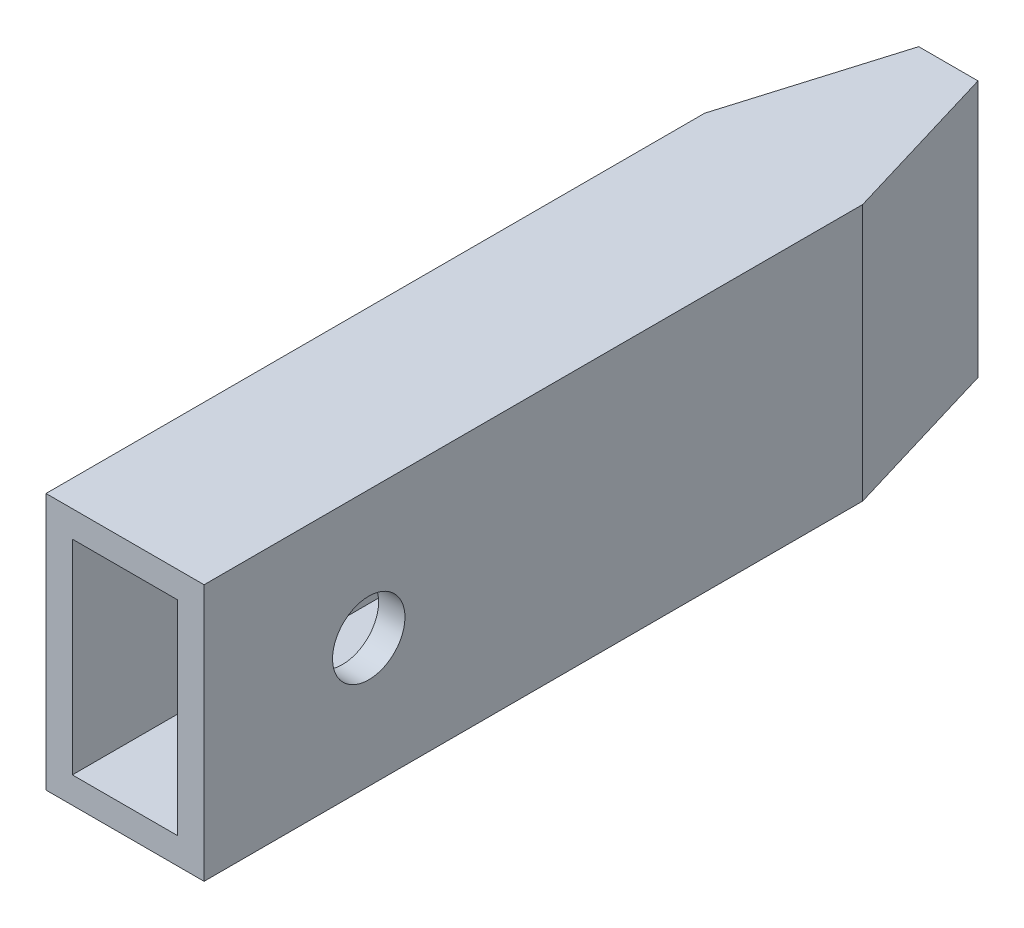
from build123d import *
from OCP.BRepFilletAPI import BRepFilletAPI_MakeChamfer

# Parameters (mm, degrees)
SKETCH1_W           = 4.8
SKETCH1_H           = 7.8
SKETCH1_W_2         = 3.2
SKETCH1_H_2         = 6.2
BOSS_EXTRUDE1_DEPTH = 20
SKETCH2_W           = 4.8
SKETCH2_H           = 7.8
BOSS_EXTRUDE2_DEPTH = 5
CHAMFER1_SIZE       = 5
CHAMFER1_SIZE2      = 1.5
SKETCH3_R           = 1.1
CUT_EXTRUDE1_DEPTH  = 5


with BuildPart() as part:
    # Sketch1 → Boss-Extrude1 (new body)
    with BuildSketch(Plane.XY):
        Rectangle(SKETCH1_W, SKETCH1_H)
        Rectangle(SKETCH1_W_2, SKETCH1_H_2, mode=Mode.SUBTRACT)
    extrude(amount=BOSS_EXTRUDE1_DEPTH)

    # Sketch2 → Boss-Extrude2 (add)
    with BuildSketch(Plane(origin=(0, 0, 0), x_dir=(-1, 0, 0), z_dir=(0, 0, -1))):
        Rectangle(SKETCH2_W, SKETCH2_H)
    extrude(amount=BOSS_EXTRUDE2_DEPTH)

    # Chamfer1: one chamfer whose edges measure the first distance from different faces: ONE call of the kernel's chamfer builder (chamfer() names one face for all edges)
    chamfer1_edges_1 = [part.edges().sort_by_distance(p)[0] for p in [
        (2.4, 0, -5),
    ]]
    chamfer1_side_1 = [part.faces().sort_by_distance(p)[0] for p in [
        (2.4, 0, 7.5),
    ]]
    chamfer1_edges_2 = [part.edges().sort_by_distance(p)[0] for p in [
        (-2.4, 0, -5),
    ]]
    chamfer1_side_2 = [part.faces().sort_by_distance(p)[0] for p in [
        (-2.4, 0, 7.5),
    ]]
    chamfer1 = BRepFilletAPI_MakeChamfer(part.part.solid().wrapped)
    for e in chamfer1_edges_1:
        chamfer1.Add(CHAMFER1_SIZE, CHAMFER1_SIZE2, e.wrapped, chamfer1_side_1[0].wrapped)  # the first distance lies on this face
    for e in chamfer1_edges_2:
        chamfer1.Add(CHAMFER1_SIZE, CHAMFER1_SIZE2, e.wrapped, chamfer1_side_2[0].wrapped)  # the first distance lies on this face
    add(Compound.cast(chamfer1.Shape()), mode=Mode.REPLACE)

    # Sketch3 → Cut-Extrude1 (cut)
    with BuildSketch(Plane(origin=(2.4, 0, 0), x_dir=(0, 0, -1), z_dir=(1, 0, 0))):
        with Locations(Location((-15, 0, 0), (0, 0, 90))):
            Circle(SKETCH3_R)
    extrude(amount=-CUT_EXTRUDE1_DEPTH, mode=Mode.SUBTRACT)


solid = part.part
